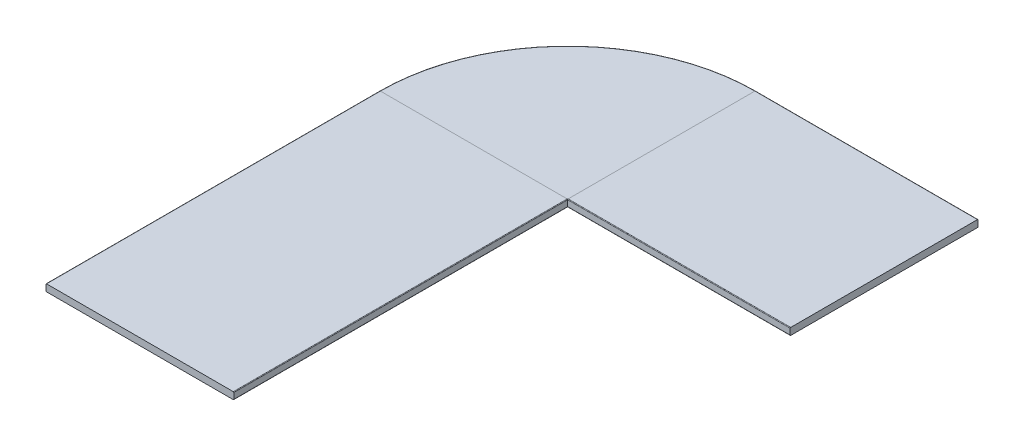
from build123d import *

# Parameters (mm, degrees)
EXTRUDE1_DEPTH = 762
SHELL1_T       = -25.4
FILLET1_R      = 2.032


with BuildPart() as part:
    # Sketch1 → Extrude1 (new body)
    with BuildSketch(Plane(origin=(0, 0, 0), x_dir=(1, 0, 0), z_dir=(0, 1, 0))):
        with BuildLine():
            Line((0, 0), (0, 1219.2))
            ThreePointArc((0, 1219.2), (200.866169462, 1704.133830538), (685.8, 1905))
            Line((685.8, 1905), (1498.6, 1905))
            Line((1498.6, 1905), (1498.6, 1219.2))
            Line((1498.6, 1219.2), (685.8, 1219.2))
            Line((685.8, 1219.2), (685.8, 0))
            Line((685.8, 0), (0, 0))
        make_face()
    extrude(amount=EXTRUDE1_DEPTH)

    # Shell1
    shell1_openings = [part.faces().sort_by_distance(p)[0] for p in [
        (0, 381, -609.6),
        (200.866169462, 381, -1704.133830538),
        (1092.2, 381, -1905),
        (1498.6, 381, -1562.1),
        (1092.2, 381, -1219.2),
        (685.8, 381, -609.6),
        (342.9, 381, 0),
        (590.680898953, 0, -1099.485458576),
    ]]
    offset(amount=SHELL1_T, openings=shell1_openings, kind=Kind.INTERSECTION)

    # Fillet1
    fillet1_edges = [part.edges().sort_by_distance(p)[0] for p in [
        (1092.2, 762, -1905),
        (0, 762, -609.6),
        (200.866169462, 762, -1704.133830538),
        (1092.2, 736.6, -1219.2),
        (685.8, 736.6, -609.6),
        (685.8, 762, -609.6),
        (1092.2, 762, -1219.2),
    ]]
    fillet(fillet1_edges, radius=FILLET1_R)


solid = part.part
